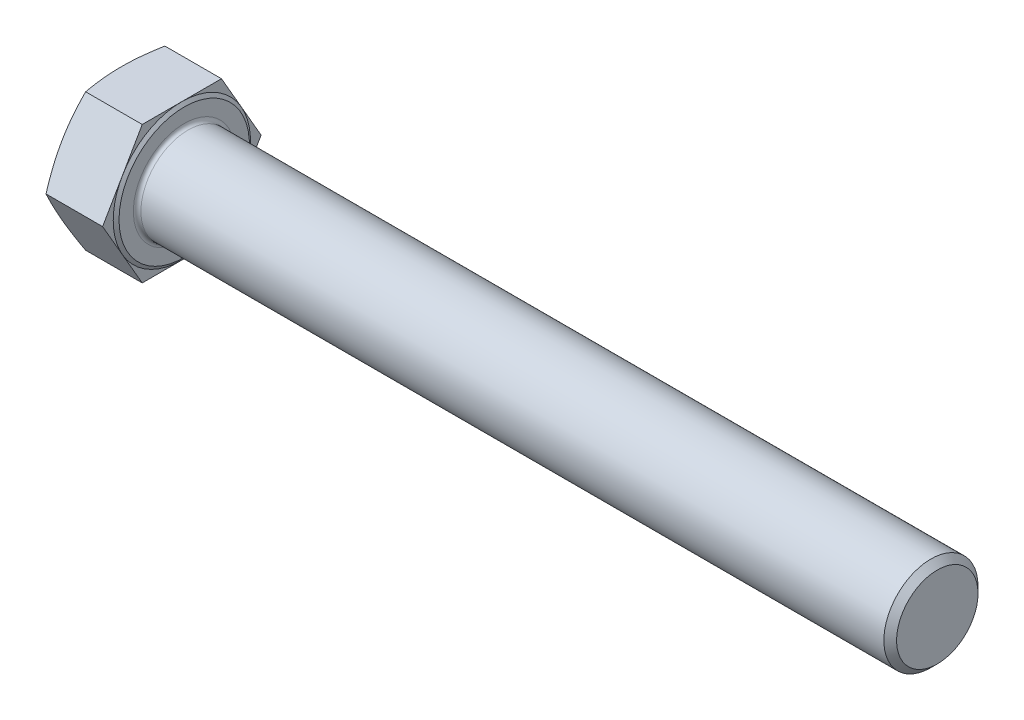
from build123d import *

# Parameters (mm, degrees)
BASEHEAD_DEPTH = 12.85
SKETCH3_R      = 10
BASEBODY_DEPTH = 160
HEADFILLET_R   = 0.8
CHAMFER1_SIZE  = 1.353


with BuildPart() as part:
    # Sketch-BaseHead → BaseHead (new body)
    with BuildSketch(Plane(origin=(0, 0, 0), x_dir=(0, 0, -1), z_dir=(1, 0, 0))):
        Polygon((16.83553385, 0), (8.417766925, 14.58), (-8.417766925, 14.58), (-16.83553385, 0), (-8.417766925, -14.58), (8.417766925, -14.58), align=None)
    extrude(amount=BASEHEAD_DEPTH)

    # Sketch4 → HeadChamfer (revolve, cut)
    with BuildSketch(Plane(origin=(-0.264637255, 0, 5.916896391), x_dir=(0, 0, -1), z_dir=(0, 1, 0))):
        Polygon((22.75243024, -0.264637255), (20.496896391, -0.264637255), (22.75243024, -1.085584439), align=None)
    revolve(axis=Axis((-4.001564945, 0, 0), (1, 0, 0)), mode=Mode.SUBTRACT)

    # Sketch1 → Revolve1 (revolve)
    with BuildSketch(Plane.XY, mode=Mode.PRIVATE) as revolve1_sk:
        Polygon((12.85, 0), (13.35, 0), (13.35, -13.85), (12.85, -14.58), align=None)
    revolve(revolve1_sk.sketch.rotate(Axis((-4.001564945, 0, 0), (1, 0, 0)), 270), axis=Axis((-4.001564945, 0, 0), (1, 0, 0)))

    # Sketch3 → BaseBody (add)
    with BuildSketch(Plane(origin=(13.35, 0, 0), x_dir=(0, 0, -1), z_dir=(1, 0, 0))):
        Circle(SKETCH3_R)
    extrude(amount=BASEBODY_DEPTH)

    # HeadFillet
    headfillet_edges = [part.edges().sort_by_distance(p)[0] for p in [
        (13.35, 0, 10),
    ]]
    fillet(headfillet_edges, radius=HEADFILLET_R)

    # Chamfer1
    chamfer1_edges = [part.edges().sort_by_distance(p)[0] for p in [
        (173.35, 0, 10),
    ]]
    chamfer(chamfer1_edges, length=CHAMFER1_SIZE)


solid = part.part
